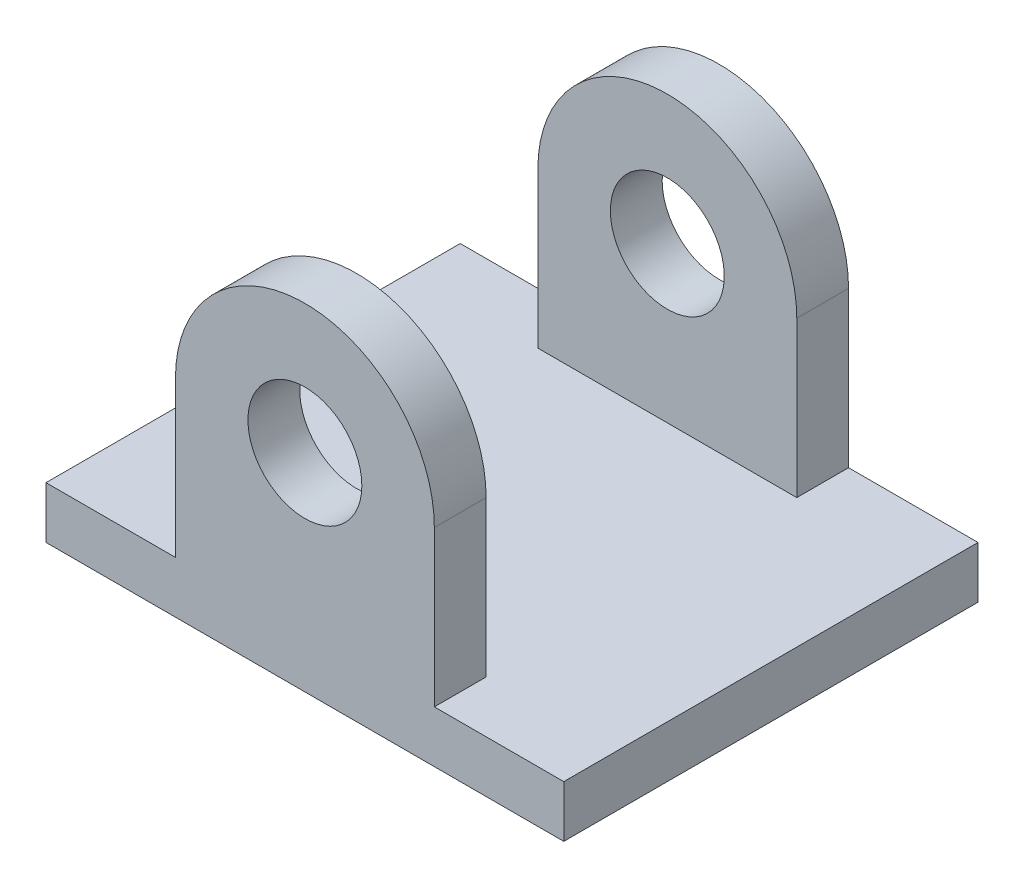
from build123d import *

# Parameters (mm, degrees)
SKETCH1_W                  = 50
SKETCH1_H                  = 40
BOSS_EXTRUDE1_DEPTH        = 5
BOSS_EXTRUDE2_DEPTH        = 5
F_11_0_11_DIAMETER_HOLE1_D = 11


with BuildPart() as part:
    # Sketch1 → Boss-Extrude1 (new body)
    with BuildSketch(Plane(origin=(0, 0, 0), x_dir=(1, 0, 0), z_dir=(0, 1, 0))):
        Rectangle(SKETCH1_W, SKETCH1_H)
    extrude(amount=BOSS_EXTRUDE1_DEPTH)

    # Sketch2 → Boss-Extrude2 (add)
    with BuildSketch(Plane.XY.offset(20)):
        with BuildLine():
            ThreePointArc((12.5, 20), (0, 32.5), (-12.5, 20))
            Line((-12.5, 20), (12.5, 20))
        make_face()
        with BuildLine():
            Line((12.5, 20), (-12.5, 20))
            ThreePointArc((-12.5, 20), (0, 7.5), (12.5, 20))
        make_face()
        with BuildLine():
            ThreePointArc((12.5, 20), (0, 32.5), (-12.5, 20))
            Line((-12.5, 20), (12.5, 20))
        make_face()
        with BuildLine():
            Line((12.5, 20), (-12.5, 20))
            ThreePointArc((-12.5, 20), (0, 7.5), (12.5, 20))
        make_face()
        with BuildLine():
            Line((-12.5, 20), (-12.5, 5))
            Line((-12.5, 5), (12.5, 5))
            Line((12.5, 5), (12.5, 20))
            ThreePointArc((12.5, 20), (0, 7.5), (-12.5, 20))
        make_face()
    boss_extrude2 = extrude(amount=-BOSS_EXTRUDE2_DEPTH)

    # 11.0 _11_ Diameter Hole1 (through all)
    with Locations(Plane.XY.offset(20)):
        with Locations((0, 20)):
            f_11_0_11_diameter_hole1 = Hole(F_11_0_11_DIAMETER_HOLE1_D / 2)

    # Mirror1: Boss-Extrude2, 11.0 _11_ Diameter Hole1 across plane
    add(boss_extrude2.mirror(Plane.XY))
    add(f_11_0_11_diameter_hole1.mirror(Plane.XY), mode=Mode.SUBTRACT)


solid = part.part
